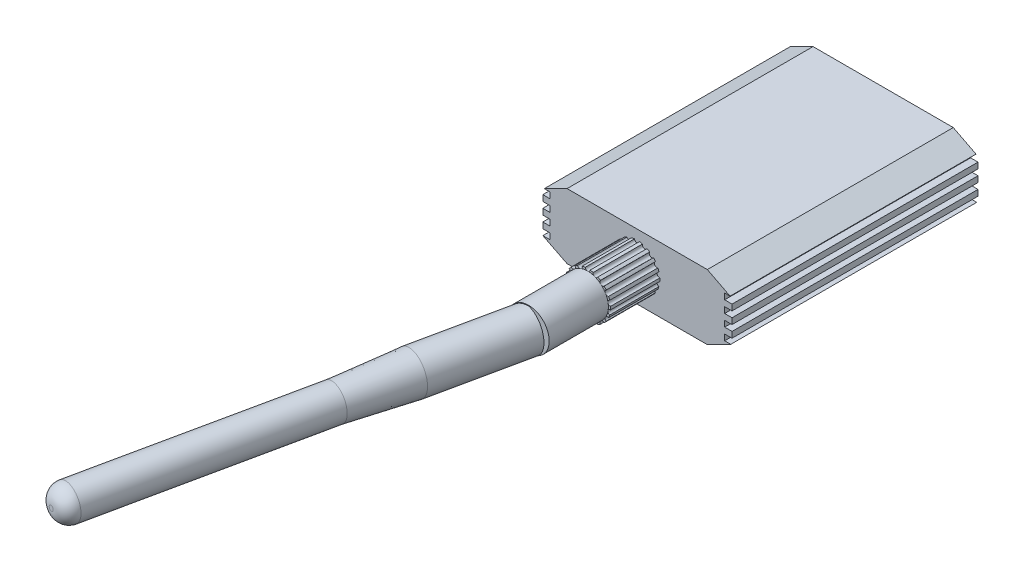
from build123d import *

# Parameters (mm, degrees)
EXTRUDE1_DEPTH     = 52.832
SKETCH2_W          = 52.832
SKETCH2_H          = 1.27
CUT_EXTRUDE1_DEPTH = 1.5875
LPATTERN1_COUNT    = 4
LPATTERN1_PITCH    = 2.54
SKETCH3_W          = 52.832
SKETCH3_H          = 1.27
CUT_EXTRUDE2_DEPTH = 1.5875
LPATTERN2_COUNT    = 4
LPATTERN2_PITCH    = 2.54
SKETCH4_R          = 4.9149
EXTRUDE2_DEPTH     = 10.5918
SKETCH5_R          = 0.525626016
CUT_EXTRUDE3_DEPTH = 10.5918
CIRPATTERN1_COUNT  = 18
SKETCH9_R          = 4.445
EXTRUDE3_DEPTH     = 12.7
SKETCH10_W         = 5.58823491
SKETCH10_H         = 11.775209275
CUT_EXTRUDE4_DEPTH = 0.508
SKETCH13_W         = 0.637432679
SKETCH13_H         = 2.485987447
SKETCH13_W_2       = 2.337253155
SKETCH13_H_2       = 0.594937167
SKETCH13_H_3       = 0.637432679
SKETCH13_H_4       = 2.528482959
SKETCH13_H_5       = 2.337253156
CUT_EXTRUDE9_DEPTH = 0.00254
FILLET3_R          = 3.048


with BuildPart() as part:
    # Sketch1 → Extrude1 (new body)
    with BuildSketch(Plane.XY):
        Polygon((-41.552816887, 6.985), (-11.428416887, 6.985), (-6.119816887, 4.267003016), (-6.119816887, -4.267003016), (-11.428416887, -6.985), (-41.552816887, -6.985), (-46.759816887, -4.371072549), (-46.759816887, 4.371072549), align=None)
    extrude(amount=EXTRUDE1_DEPTH)

    # Sketch2 → Cut-Extrude1 (cut)
    with BuildSketch(Plane.ZY.offset(46.759816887)):
        with Locations((26.416, 3.889962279)):
            Rectangle(SKETCH2_W, SKETCH2_H)
    cut_extrude1 = extrude(amount=-CUT_EXTRUDE1_DEPTH, mode=Mode.SUBTRACT)

    # LPattern1: Cut-Extrude1 ×4
    with Locations(*[(0, -i * LPATTERN1_PITCH, 0) for i in range(1, LPATTERN1_COUNT)]):
        add(cut_extrude1, mode=Mode.SUBTRACT)

    # Sketch3 → Cut-Extrude2 (cut)
    with BuildSketch(Plane(origin=(-6.119816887, 0, 0), x_dir=(0, 0, -1), z_dir=(1, 0, 0))):
        with Locations((-26.416, 3.849561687)):
            Rectangle(SKETCH3_W, SKETCH3_H)
    cut_extrude2 = extrude(amount=-CUT_EXTRUDE2_DEPTH, mode=Mode.SUBTRACT)

    # LPattern2: Cut-Extrude2 ×4
    with Locations(*[(0, -i * LPATTERN2_PITCH, 0) for i in range(1, LPATTERN2_COUNT)]):
        add(cut_extrude2, mode=Mode.SUBTRACT)

    # Sketch4 → Extrude2 (add)
    with BuildSketch(Plane.XY.offset(52.832)):
        with Locations((-26.539653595, 0)):
            Circle(SKETCH4_R)
    extrude(amount=EXTRUDE2_DEPTH)

    # Sketch5 → Cut-Extrude3 (cut)
    with BuildSketch(Plane.XY.offset(63.4238)):
        with Locations((-26.539653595, 4.9149)):
            Circle(SKETCH5_R)
    cut_extrude3 = extrude(amount=-CUT_EXTRUDE3_DEPTH, mode=Mode.SUBTRACT)

    # CirPattern1: Cut-Extrude3 ×18 about axis
    cirpattern1_axis = Axis((-26.539653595, 0, 0), (0, 0, 1))
    for i in range(1, CIRPATTERN1_COUNT):
        add(cut_extrude3.rotate(cirpattern1_axis, i * 360 / CIRPATTERN1_COUNT), mode=Mode.SUBTRACT)

    # Sketch9 → Extrude3 (add)
    with BuildSketch(Plane.XY.offset(63.4238)):
        with Locations(Location((-26.539653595, 0, 0), (0, 0, 172.887557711))):
            Circle(SKETCH9_R)
    extrude(amount=EXTRUDE3_DEPTH)

    # Sketch10 → Cut-Extrude4 (cut)
    with BuildSketch(Plane.XZ.offset(6.985)):
        with Locations((-31.72868207, 41.12635654)):
            Rectangle(SKETCH10_W, SKETCH10_H)
    extrude(amount=-CUT_EXTRUDE4_DEPTH, mode=Mode.SUBTRACT)

    # Sketch13 → Cut-Extrude9 (cut)
    with BuildSketch(Plane.XZ.offset(6.477)):
        with Locations((-30.28935042, 42.676965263)):
            Rectangle(SKETCH13_W, SKETCH13_H)
        with Locations((-31.776693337, 44.53614391)):
            Rectangle(SKETCH13_W_2, SKETCH13_H_2)
        with Locations((-33.264036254, 42.676965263)):
            Rectangle(SKETCH13_W, SKETCH13_H)
        with Locations((-31.776693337, 40.839034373)):
            Rectangle(SKETCH13_W_2, SKETCH13_H_3)
        with Locations((-30.28935042, 39.001103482)):
            Rectangle(SKETCH13_W, SKETCH13_H_4)
        with Locations((-31.776693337, 37.078181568)):
            Rectangle(SKETCH13_W_2, SKETCH13_H_2)
        with Locations((-33.264036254, 38.90548858)):
            Rectangle(SKETCH13_W, SKETCH13_H_5)
    extrude(amount=-CUT_EXTRUDE9_DEPTH, mode=Mode.SUBTRACT)

    # Sketch15 → Revolve1 (revolve)
    with BuildSketch(Plane(origin=(0, 0, 0), x_dir=(1, 0, 0), z_dir=(0, 1, 0)), mode=Mode.PRIVATE) as revolve1_sk:
        Polygon((-26.539653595, -76.1238), (-22.33731385, -77.015054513), (-26.713589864, -97.649562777), (-30.317157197, -111.30103337), (-40.954649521, -161.457701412), (-44.479185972, -160.710199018), align=None)
    revolve(revolve1_sk.sketch.rotate(Axis((-26.539653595, 0, 76.1238), (-0.207470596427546, 0, 0.9782412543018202)), 180), axis=Axis((-26.539653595, 0, 76.1238), (-0.207470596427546, 0, 0.9782412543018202)))

    # Fillet3
    fillet3_edges = [part.edges().sort_by_distance(p)[0] for p in [
        (-40.954649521, 0, 161.457701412),
    ]]
    fillet(fillet3_edges, radius=FILLET3_R)


solid = part.part
